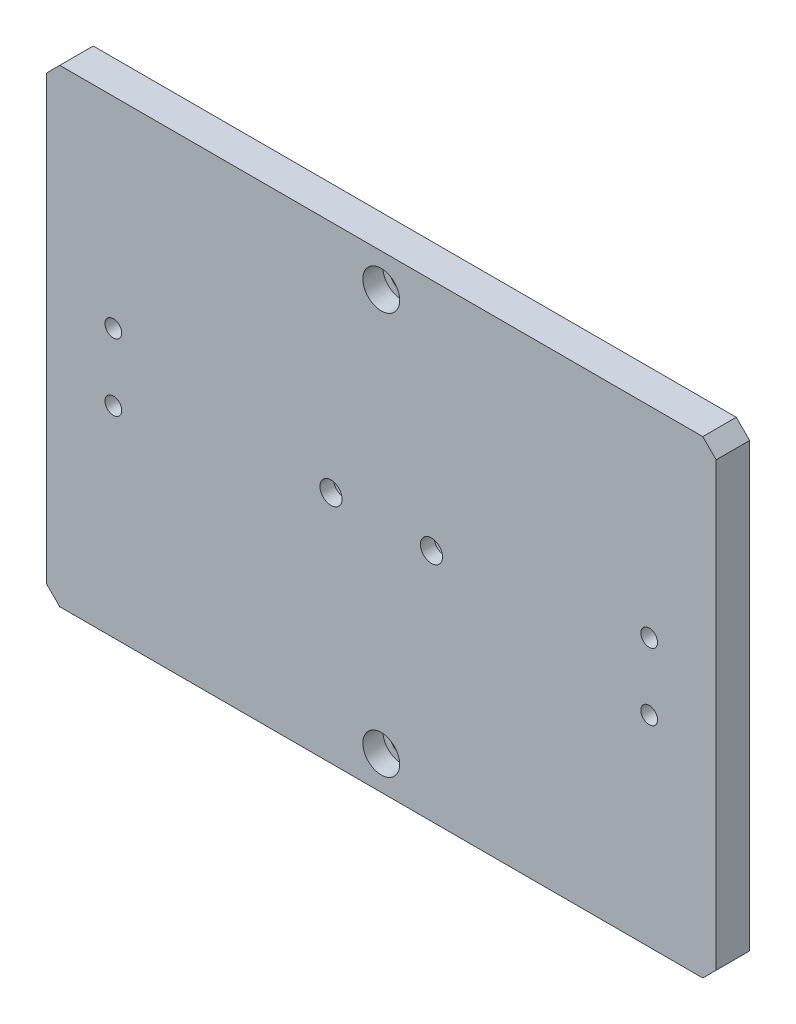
ISO-10303-21;
HEADER;
FILE_DESCRIPTION(('STEP AP214'),'2;1');
FILE_NAME('part.step','',(''),(''),'','','');
FILE_SCHEMA(('AUTOMOTIVE_DESIGN { 1 0 10303 214 1 1 1 1 }'));
ENDSEC;
DATA;
#1=APPLICATION_CONTEXT('core data for automotive mechanical design processes');
#2=APPLICATION_PROTOCOL_DEFINITION('international standard','automotive_design',2000,#1);
#3=PRODUCT_CONTEXT('',#1,'mechanical');
#4=PRODUCT('Part','Part','',(#3));
#5=PRODUCT_RELATED_PRODUCT_CATEGORY('part','',(#4));
#6=PRODUCT_DEFINITION_FORMATION('','',#4);
#7=PRODUCT_DEFINITION_CONTEXT('part definition',#1,'design');
#8=PRODUCT_DEFINITION('design','',#6,#7);
#9=PRODUCT_DEFINITION_SHAPE('','',#8);
#10=(LENGTH_UNIT() NAMED_UNIT(*) SI_UNIT(.MILLI.,.METRE.));
#11=(NAMED_UNIT(*) PLANE_ANGLE_UNIT() SI_UNIT($,.RADIAN.));
#12=(NAMED_UNIT(*) SI_UNIT($,.STERADIAN.) SOLID_ANGLE_UNIT());
#13=UNCERTAINTY_MEASURE_WITH_UNIT(LENGTH_MEASURE(1.E-05),#10,'distance_accuracy_value','');
#14=(GEOMETRIC_REPRESENTATION_CONTEXT(3) GLOBAL_UNCERTAINTY_ASSIGNED_CONTEXT((#13)) GLOBAL_UNIT_ASSIGNED_CONTEXT((#10,
#11,#12)) REPRESENTATION_CONTEXT('',''));
#15=CARTESIAN_POINT('',(0.,0.,0.));
#16=DIRECTION('',(0.,0.,1.));
#17=DIRECTION('',(1.,0.,0.));
#18=AXIS2_PLACEMENT_3D('',#15,#16,#17);
#19=CARTESIAN_POINT('',(0.,0.,10.));
#20=DIRECTION('',(1.,0.,0.));
#21=DIRECTION('',(0.,0.,-1.));
#22=AXIS2_PLACEMENT_3D('',#19,#20,#21);
#23=PLANE('',#22);
#24=DIRECTION('',(0.,-1.,0.));
#25=VECTOR('',#24,1.);
#26=CARTESIAN_POINT('',(0.,0.,10.));
#27=LINE('',#26,#25);
#28=CARTESIAN_POINT('',(0.,136.,10.));
#29=VERTEX_POINT('',#28);
#30=CARTESIAN_POINT('',(0.,4.00000000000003,10.));
#31=VERTEX_POINT('',#30);
#32=EDGE_CURVE('E129',#29,#31,#27,.T.);
#33=ORIENTED_EDGE('',*,*,#32,.F.);
#34=DIRECTION('',(0.,0.,-1.));
#35=VECTOR('',#34,1.);
#36=CARTESIAN_POINT('',(0.,136.,10.));
#37=LINE('',#36,#35);
#38=CARTESIAN_POINT('',(0.,136.,0.));
#39=VERTEX_POINT('',#38);
#40=EDGE_CURVE('E155',#29,#39,#37,.T.);
#41=ORIENTED_EDGE('',*,*,#40,.T.);
#42=DIRECTION('',(0.,-1.,0.));
#43=VECTOR('',#42,1.);
#44=CARTESIAN_POINT('',(0.,0.,0.));
#45=LINE('',#44,#43);
#46=CARTESIAN_POINT('',(0.,4.00000000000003,0.));
#47=VERTEX_POINT('',#46);
#48=EDGE_CURVE('E230',#39,#47,#45,.T.);
#49=ORIENTED_EDGE('',*,*,#48,.T.);
#50=DIRECTION('',(0.,0.,1.));
#51=VECTOR('',#50,1.);
#52=CARTESIAN_POINT('',(0.,4.00000000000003,10.));
#53=LINE('',#52,#51);
#54=EDGE_CURVE('E153',#47,#31,#53,.T.);
#55=ORIENTED_EDGE('',*,*,#54,.T.);
#56=EDGE_LOOP('',(#33,#41,#49,#55));
#57=FACE_BOUND('',#56,.T.);
#58=ADVANCED_FACE('F35',(#57),#23,.F.);
#59=CARTESIAN_POINT('',(0.,0.,10.));
#60=DIRECTION('',(0.,1.,0.));
#61=DIRECTION('',(0.,0.,1.));
#62=AXIS2_PLACEMENT_3D('',#59,#60,#61);
#63=PLANE('',#62);
#64=DIRECTION('',(1.,0.,0.));
#65=VECTOR('',#64,1.);
#66=CARTESIAN_POINT('',(0.,0.,10.));
#67=LINE('',#66,#65);
#68=CARTESIAN_POINT('',(4.,0.,10.));
#69=VERTEX_POINT('',#68);
#70=CARTESIAN_POINT('',(196.,0.,10.));
#71=VERTEX_POINT('',#70);
#72=EDGE_CURVE('E132',#69,#71,#67,.T.);
#73=ORIENTED_EDGE('',*,*,#72,.F.);
#74=DIRECTION('',(0.,0.,-1.));
#75=VECTOR('',#74,1.);
#76=CARTESIAN_POINT('',(4.,0.,10.));
#77=LINE('',#76,#75);
#78=CARTESIAN_POINT('',(4.00000000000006,0.,0.));
#79=VERTEX_POINT('',#78);
#80=EDGE_CURVE('E11',#69,#79,#77,.T.);
#81=ORIENTED_EDGE('',*,*,#80,.T.);
#82=DIRECTION('',(1.,0.,0.));
#83=VECTOR('',#82,1.);
#84=CARTESIAN_POINT('',(0.,0.,0.));
#85=LINE('',#84,#83);
#86=CARTESIAN_POINT('',(196.,0.,0.));
#87=VERTEX_POINT('',#86);
#88=EDGE_CURVE('E134',#79,#87,#85,.T.);
#89=ORIENTED_EDGE('',*,*,#88,.T.);
#90=DIRECTION('',(0.,0.,1.));
#91=VECTOR('',#90,1.);
#92=CARTESIAN_POINT('',(196.,0.,10.));
#93=LINE('',#92,#91);
#94=EDGE_CURVE('E44',#87,#71,#93,.T.);
#95=ORIENTED_EDGE('',*,*,#94,.T.);
#96=EDGE_LOOP('',(#73,#81,#89,#95));
#97=FACE_BOUND('',#96,.T.);
#98=ADVANCED_FACE('F239',(#97),#63,.F.);
#99=CARTESIAN_POINT('',(200.,0.,10.));
#100=DIRECTION('',(-1.,0.,0.));
#101=DIRECTION('',(0.,0.,1.));
#102=AXIS2_PLACEMENT_3D('',#99,#100,#101);
#103=PLANE('',#102);
#104=DIRECTION('',(0.,1.,0.));
#105=VECTOR('',#104,1.);
#106=CARTESIAN_POINT('',(200.,0.,0.));
#107=LINE('',#106,#105);
#108=CARTESIAN_POINT('',(200.,4.00000000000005,0.));
#109=VERTEX_POINT('',#108);
#110=CARTESIAN_POINT('',(200.,136.,0.));
#111=VERTEX_POINT('',#110);
#112=EDGE_CURVE('E130',#109,#111,#107,.T.);
#113=ORIENTED_EDGE('',*,*,#112,.T.);
#114=DIRECTION('',(0.,0.,1.));
#115=VECTOR('',#114,1.);
#116=CARTESIAN_POINT('',(200.,136.,10.));
#117=LINE('',#116,#115);
#118=CARTESIAN_POINT('',(200.,136.,10.));
#119=VERTEX_POINT('',#118);
#120=EDGE_CURVE('E108',#111,#119,#117,.T.);
#121=ORIENTED_EDGE('',*,*,#120,.T.);
#122=DIRECTION('',(0.,1.,0.));
#123=VECTOR('',#122,1.);
#124=CARTESIAN_POINT('',(200.,0.,10.));
#125=LINE('',#124,#123);
#126=CARTESIAN_POINT('',(200.,4.,10.));
#127=VERTEX_POINT('',#126);
#128=EDGE_CURVE('E233',#127,#119,#125,.T.);
#129=ORIENTED_EDGE('',*,*,#128,.F.);
#130=DIRECTION('',(0.,0.,-1.));
#131=VECTOR('',#130,1.);
#132=CARTESIAN_POINT('',(200.,4.,10.));
#133=LINE('',#132,#131);
#134=EDGE_CURVE('E113',#127,#109,#133,.T.);
#135=ORIENTED_EDGE('',*,*,#134,.T.);
#136=EDGE_LOOP('',(#113,#121,#129,#135));
#137=FACE_BOUND('',#136,.T.);
#138=ADVANCED_FACE('F247',(#137),#103,.F.);
#139=CARTESIAN_POINT('',(0.,140.,10.));
#140=DIRECTION('',(0.,-1.,0.));
#141=DIRECTION('',(0.,0.,-1.));
#142=AXIS2_PLACEMENT_3D('',#139,#140,#141);
#143=PLANE('',#142);
#144=DIRECTION('',(-1.,0.,0.));
#145=VECTOR('',#144,1.);
#146=CARTESIAN_POINT('',(0.,140.,10.));
#147=LINE('',#146,#145);
#148=CARTESIAN_POINT('',(196.,140.,10.));
#149=VERTEX_POINT('',#148);
#150=CARTESIAN_POINT('',(4.00000000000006,140.,10.));
#151=VERTEX_POINT('',#150);
#152=EDGE_CURVE('E123',#149,#151,#147,.T.);
#153=ORIENTED_EDGE('',*,*,#152,.F.);
#154=DIRECTION('',(0.,0.,-1.));
#155=VECTOR('',#154,1.);
#156=CARTESIAN_POINT('',(196.,140.,10.));
#157=LINE('',#156,#155);
#158=CARTESIAN_POINT('',(196.,140.,0.));
#159=VERTEX_POINT('',#158);
#160=EDGE_CURVE('E107',#149,#159,#157,.T.);
#161=ORIENTED_EDGE('',*,*,#160,.T.);
#162=DIRECTION('',(-1.,0.,0.));
#163=VECTOR('',#162,1.);
#164=CARTESIAN_POINT('',(0.,140.,0.));
#165=LINE('',#164,#163);
#166=CARTESIAN_POINT('',(4.00000000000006,140.,0.));
#167=VERTEX_POINT('',#166);
#168=EDGE_CURVE('E120',#159,#167,#165,.T.);
#169=ORIENTED_EDGE('',*,*,#168,.T.);
#170=DIRECTION('',(0.,0.,1.));
#171=VECTOR('',#170,1.);
#172=CARTESIAN_POINT('',(4.00000000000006,140.,10.));
#173=LINE('',#172,#171);
#174=EDGE_CURVE('E125',#167,#151,#173,.T.);
#175=ORIENTED_EDGE('',*,*,#174,.T.);
#176=EDGE_LOOP('',(#153,#161,#169,#175));
#177=FACE_BOUND('',#176,.T.);
#178=ADVANCED_FACE('F119',(#177),#143,.F.);
#179=CARTESIAN_POINT('',(0.,140.,10.));
#180=DIRECTION('',(0.,0.,-1.));
#181=DIRECTION('',(-1.,0.,0.));
#182=AXIS2_PLACEMENT_3D('',#179,#180,#181);
#183=PLANE('',#182);
#184=CARTESIAN_POINT('',(20.,60.,10.));
#185=DIRECTION('',(0.,0.,1.));
#186=DIRECTION('',(1.,0.,0.));
#187=AXIS2_PLACEMENT_3D('',#184,#185,#186);
#188=CIRCLE('',#187,2.49999999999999);
#189=CARTESIAN_POINT('',(22.5,60.,10.));
#190=VERTEX_POINT('',#189);
#191=EDGE_CURVE('E172',#190,#190,#188,.T.);
#192=ORIENTED_EDGE('',*,*,#191,.F.);
#193=EDGE_LOOP('',(#192));
#194=FACE_BOUND('',#193,.T.);
#195=CARTESIAN_POINT('',(180.,60.,10.));
#196=DIRECTION('',(0.,0.,1.));
#197=DIRECTION('',(1.,0.,0.));
#198=AXIS2_PLACEMENT_3D('',#195,#196,#197);
#199=CIRCLE('',#198,2.5);
#200=CARTESIAN_POINT('',(182.5,60.,10.));
#201=VERTEX_POINT('',#200);
#202=EDGE_CURVE('E161',#201,#201,#199,.T.);
#203=ORIENTED_EDGE('',*,*,#202,.F.);
#204=EDGE_LOOP('',(#203));
#205=FACE_BOUND('',#204,.T.);
#206=CARTESIAN_POINT('',(20.,80.,10.));
#207=DIRECTION('',(0.,0.,1.));
#208=DIRECTION('',(1.,0.,0.));
#209=AXIS2_PLACEMENT_3D('',#206,#207,#208);
#210=CIRCLE('',#209,2.49999999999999);
#211=CARTESIAN_POINT('',(22.5,80.,10.));
#212=VERTEX_POINT('',#211);
#213=EDGE_CURVE('E160',#212,#212,#210,.T.);
#214=ORIENTED_EDGE('',*,*,#213,.F.);
#215=EDGE_LOOP('',(#214));
#216=FACE_BOUND('',#215,.T.);
#217=CARTESIAN_POINT('',(180.,80.,10.));
#218=DIRECTION('',(0.,0.,1.));
#219=DIRECTION('',(1.,0.,0.));
#220=AXIS2_PLACEMENT_3D('',#217,#218,#219);
#221=CIRCLE('',#220,2.5);
#222=CARTESIAN_POINT('',(182.5,80.,10.));
#223=VERTEX_POINT('',#222);
#224=EDGE_CURVE('E177',#223,#223,#221,.T.);
#225=ORIENTED_EDGE('',*,*,#224,.F.);
#226=EDGE_LOOP('',(#225));
#227=FACE_BOUND('',#226,.T.);
#228=CARTESIAN_POINT('',(100.,130.,10.));
#229=DIRECTION('',(0.,0.,1.));
#230=DIRECTION('',(1.,0.,0.));
#231=AXIS2_PLACEMENT_3D('',#228,#229,#230);
#232=CIRCLE('',#231,5.50000000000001);
#233=CARTESIAN_POINT('',(105.5,130.,10.));
#234=VERTEX_POINT('',#233);
#235=EDGE_CURVE('E183',#234,#234,#232,.T.);
#236=ORIENTED_EDGE('',*,*,#235,.F.);
#237=EDGE_LOOP('',(#236));
#238=FACE_BOUND('',#237,.T.);
#239=CARTESIAN_POINT('',(100.,10.,10.));
#240=DIRECTION('',(0.,0.,1.));
#241=DIRECTION('',(1.,0.,0.));
#242=AXIS2_PLACEMENT_3D('',#239,#240,#241);
#243=CIRCLE('',#242,5.50000000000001);
#244=CARTESIAN_POINT('',(105.5,10.,10.));
#245=VERTEX_POINT('',#244);
#246=EDGE_CURVE('E195',#245,#245,#243,.T.);
#247=ORIENTED_EDGE('',*,*,#246,.F.);
#248=EDGE_LOOP('',(#247));
#249=FACE_BOUND('',#248,.T.);
#250=CARTESIAN_POINT('',(115.,70.,10.));
#251=DIRECTION('',(0.,0.,-1.));
#252=DIRECTION('',(-1.,0.,0.));
#253=AXIS2_PLACEMENT_3D('',#250,#251,#252);
#254=CIRCLE('',#253,3.3);
#255=CARTESIAN_POINT('',(111.7,70.,10.));
#256=VERTEX_POINT('',#255);
#257=EDGE_CURVE('E216',#256,#256,#254,.T.);
#258=ORIENTED_EDGE('',*,*,#257,.T.);
#259=EDGE_LOOP('',(#258));
#260=FACE_BOUND('',#259,.T.);
#261=CARTESIAN_POINT('',(85.,70.,10.));
#262=DIRECTION('',(0.,0.,-1.));
#263=DIRECTION('',(-1.,0.,0.));
#264=AXIS2_PLACEMENT_3D('',#261,#262,#263);
#265=CIRCLE('',#264,3.3);
#266=CARTESIAN_POINT('',(81.7,70.,10.));
#267=VERTEX_POINT('',#266);
#268=EDGE_CURVE('E228',#267,#267,#265,.T.);
#269=ORIENTED_EDGE('',*,*,#268,.T.);
#270=EDGE_LOOP('',(#269));
#271=FACE_BOUND('',#270,.T.);
#272=ORIENTED_EDGE('',*,*,#128,.T.);
#273=DIRECTION('',(0.707106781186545,-0.70710678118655,0.));
#274=VECTOR('',#273,1.);
#275=CARTESIAN_POINT('',(196.,140.,10.));
#276=LINE('',#275,#274);
#277=EDGE_CURVE('E151',#119,#149,#276,.F.);
#278=ORIENTED_EDGE('',*,*,#277,.T.);
#279=ORIENTED_EDGE('',*,*,#152,.T.);
#280=DIRECTION('',(0.70710678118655,0.707106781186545,0.));
#281=VECTOR('',#280,1.);
#282=CARTESIAN_POINT('',(0.,136.,10.));
#283=LINE('',#282,#281);
#284=EDGE_CURVE('E149',#151,#29,#283,.F.);
#285=ORIENTED_EDGE('',*,*,#284,.T.);
#286=ORIENTED_EDGE('',*,*,#32,.T.);
#287=DIRECTION('',(-0.707106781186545,0.70710678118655,0.));
#288=VECTOR('',#287,1.);
#289=CARTESIAN_POINT('',(4.,0.,10.));
#290=LINE('',#289,#288);
#291=EDGE_CURVE('E58',#31,#69,#290,.F.);
#292=ORIENTED_EDGE('',*,*,#291,.T.);
#293=ORIENTED_EDGE('',*,*,#72,.T.);
#294=DIRECTION('',(-0.70710678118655,-0.707106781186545,0.));
#295=VECTOR('',#294,1.);
#296=CARTESIAN_POINT('',(200.,4.,10.));
#297=LINE('',#296,#295);
#298=EDGE_CURVE('E146',#71,#127,#297,.F.);
#299=ORIENTED_EDGE('',*,*,#298,.T.);
#300=EDGE_LOOP('',(#272,#278,#279,#285,#286,#292,#293,#299));
#301=FACE_BOUND('',#300,.T.);
#302=ADVANCED_FACE('F245',(#194,#205,#216,#227,#238,#249,#260,#271,#301),#183,.F.);
#303=CARTESIAN_POINT('',(0.,140.,0.));
#304=DIRECTION('',(0.,0.,-1.));
#305=DIRECTION('',(-1.,0.,0.));
#306=AXIS2_PLACEMENT_3D('',#303,#304,#305);
#307=PLANE('',#306);
#308=CARTESIAN_POINT('',(20.,60.,0.));
#309=DIRECTION('',(0.,0.,-1.));
#310=DIRECTION('',(-1.,0.,0.));
#311=AXIS2_PLACEMENT_3D('',#308,#309,#310);
#312=CIRCLE('',#311,2.49999999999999);
#313=CARTESIAN_POINT('',(17.5,60.,0.));
#314=VERTEX_POINT('',#313);
#315=EDGE_CURVE('E39',#314,#314,#312,.T.);
#316=ORIENTED_EDGE('',*,*,#315,.F.);
#317=EDGE_LOOP('',(#316));
#318=FACE_BOUND('',#317,.T.);
#319=CARTESIAN_POINT('',(180.,60.,0.));
#320=DIRECTION('',(0.,0.,-1.));
#321=DIRECTION('',(-1.,0.,0.));
#322=AXIS2_PLACEMENT_3D('',#319,#320,#321);
#323=CIRCLE('',#322,2.5);
#324=CARTESIAN_POINT('',(177.5,60.,0.));
#325=VERTEX_POINT('',#324);
#326=EDGE_CURVE('E158',#325,#325,#323,.T.);
#327=ORIENTED_EDGE('',*,*,#326,.F.);
#328=EDGE_LOOP('',(#327));
#329=FACE_BOUND('',#328,.T.);
#330=CARTESIAN_POINT('',(20.,80.,0.));
#331=DIRECTION('',(0.,0.,-1.));
#332=DIRECTION('',(-1.,0.,0.));
#333=AXIS2_PLACEMENT_3D('',#330,#331,#332);
#334=CIRCLE('',#333,2.49999999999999);
#335=CARTESIAN_POINT('',(17.5,80.,0.));
#336=VERTEX_POINT('',#335);
#337=EDGE_CURVE('E165',#336,#336,#334,.T.);
#338=ORIENTED_EDGE('',*,*,#337,.F.);
#339=EDGE_LOOP('',(#338));
#340=FACE_BOUND('',#339,.T.);
#341=CARTESIAN_POINT('',(180.,80.,0.));
#342=DIRECTION('',(0.,0.,-1.));
#343=DIRECTION('',(-1.,0.,0.));
#344=AXIS2_PLACEMENT_3D('',#341,#342,#343);
#345=CIRCLE('',#344,2.49999999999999);
#346=CARTESIAN_POINT('',(177.5,80.,0.));
#347=VERTEX_POINT('',#346);
#348=EDGE_CURVE('E180',#347,#347,#345,.T.);
#349=ORIENTED_EDGE('',*,*,#348,.F.);
#350=EDGE_LOOP('',(#349));
#351=FACE_BOUND('',#350,.T.);
#352=CARTESIAN_POINT('',(100.,130.,0.));
#353=DIRECTION('',(0.,0.,1.));
#354=DIRECTION('',(1.,0.,0.));
#355=AXIS2_PLACEMENT_3D('',#352,#353,#354);
#356=CIRCLE('',#355,3.3);
#357=CARTESIAN_POINT('',(103.3,130.,0.));
#358=VERTEX_POINT('',#357);
#359=EDGE_CURVE('E192',#358,#358,#356,.T.);
#360=ORIENTED_EDGE('',*,*,#359,.T.);
#361=EDGE_LOOP('',(#360));
#362=FACE_BOUND('',#361,.T.);
#363=CARTESIAN_POINT('',(100.,10.,0.));
#364=DIRECTION('',(0.,0.,1.));
#365=DIRECTION('',(1.,0.,0.));
#366=AXIS2_PLACEMENT_3D('',#363,#364,#365);
#367=CIRCLE('',#366,3.3);
#368=CARTESIAN_POINT('',(103.3,10.,0.));
#369=VERTEX_POINT('',#368);
#370=EDGE_CURVE('E204',#369,#369,#367,.T.);
#371=ORIENTED_EDGE('',*,*,#370,.T.);
#372=EDGE_LOOP('',(#371));
#373=FACE_BOUND('',#372,.T.);
#374=CARTESIAN_POINT('',(115.,70.,0.));
#375=DIRECTION('',(0.,0.,-1.));
#376=DIRECTION('',(-1.,0.,0.));
#377=AXIS2_PLACEMENT_3D('',#374,#375,#376);
#378=CIRCLE('',#377,5.49999999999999);
#379=CARTESIAN_POINT('',(109.5,70.,0.));
#380=VERTEX_POINT('',#379);
#381=EDGE_CURVE('E207',#380,#380,#378,.T.);
#382=ORIENTED_EDGE('',*,*,#381,.F.);
#383=EDGE_LOOP('',(#382));
#384=FACE_BOUND('',#383,.T.);
#385=CARTESIAN_POINT('',(85.,70.,0.));
#386=DIRECTION('',(0.,0.,-1.));
#387=DIRECTION('',(-1.,0.,0.));
#388=AXIS2_PLACEMENT_3D('',#385,#386,#387);
#389=CIRCLE('',#388,5.49999999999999);
#390=CARTESIAN_POINT('',(79.5,70.,0.));
#391=VERTEX_POINT('',#390);
#392=EDGE_CURVE('E219',#391,#391,#389,.T.);
#393=ORIENTED_EDGE('',*,*,#392,.F.);
#394=EDGE_LOOP('',(#393));
#395=FACE_BOUND('',#394,.T.);
#396=ORIENTED_EDGE('',*,*,#168,.F.);
#397=DIRECTION('',(-0.707106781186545,0.70710678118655,0.));
#398=VECTOR('',#397,1.);
#399=CARTESIAN_POINT('',(98.0000000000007,238.,0.));
#400=LINE('',#399,#398);
#401=EDGE_CURVE('E103',#159,#111,#400,.F.);
#402=ORIENTED_EDGE('',*,*,#401,.T.);
#403=ORIENTED_EDGE('',*,*,#112,.F.);
#404=DIRECTION('',(0.70710678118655,0.707106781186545,0.));
#405=VECTOR('',#404,1.);
#406=CARTESIAN_POINT('',(167.999999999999,-28.0000000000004,0.));
#407=LINE('',#406,#405);
#408=EDGE_CURVE('E124',#109,#87,#407,.F.);
#409=ORIENTED_EDGE('',*,*,#408,.T.);
#410=ORIENTED_EDGE('',*,*,#88,.F.);
#411=DIRECTION('',(0.707106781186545,-0.70710678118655,0.));
#412=VECTOR('',#411,1.);
#413=CARTESIAN_POINT('',(-68.,72.0000000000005,0.));
#414=LINE('',#413,#412);
#415=EDGE_CURVE('E140',#79,#47,#414,.F.);
#416=ORIENTED_EDGE('',*,*,#415,.T.);
#417=ORIENTED_EDGE('',*,*,#48,.F.);
#418=DIRECTION('',(-0.70710678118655,-0.707106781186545,0.));
#419=VECTOR('',#418,1.);
#420=CARTESIAN_POINT('',(2.00000000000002,138.,0.));
#421=LINE('',#420,#419);
#422=EDGE_CURVE('E114',#39,#167,#421,.F.);
#423=ORIENTED_EDGE('',*,*,#422,.T.);
#424=EDGE_LOOP('',(#396,#402,#403,#409,#410,#416,#417,#423));
#425=FACE_BOUND('',#424,.T.);
#426=ADVANCED_FACE('F127',(#318,#329,#340,#351,#362,#373,#384,#395,#425),#307,.T.);
#427=CARTESIAN_POINT('',(196.,140.,10.));
#428=DIRECTION('',(-0.70710678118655,-0.707106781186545,0.));
#429=DIRECTION('',(0.707106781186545,-0.70710678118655,0.));
#430=AXIS2_PLACEMENT_3D('',#427,#428,#429);
#431=PLANE('',#430);
#432=ORIENTED_EDGE('',*,*,#277,.F.);
#433=ORIENTED_EDGE('',*,*,#120,.F.);
#434=ORIENTED_EDGE('',*,*,#401,.F.);
#435=ORIENTED_EDGE('',*,*,#160,.F.);
#436=EDGE_LOOP('',(#432,#433,#434,#435));
#437=FACE_BOUND('',#436,.T.);
#438=ADVANCED_FACE('F106',(#437),#431,.F.);
#439=CARTESIAN_POINT('',(0.,136.,10.));
#440=DIRECTION('',(0.707106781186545,-0.70710678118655,0.));
#441=DIRECTION('',(0.70710678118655,0.707106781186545,0.));
#442=AXIS2_PLACEMENT_3D('',#439,#440,#441);
#443=PLANE('',#442);
#444=ORIENTED_EDGE('',*,*,#284,.F.);
#445=ORIENTED_EDGE('',*,*,#174,.F.);
#446=ORIENTED_EDGE('',*,*,#422,.F.);
#447=ORIENTED_EDGE('',*,*,#40,.F.);
#448=EDGE_LOOP('',(#444,#445,#446,#447));
#449=FACE_BOUND('',#448,.T.);
#450=ADVANCED_FACE('F265',(#449),#443,.F.);
#451=CARTESIAN_POINT('',(4.,0.,10.));
#452=DIRECTION('',(0.70710678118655,0.707106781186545,0.));
#453=DIRECTION('',(-0.707106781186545,0.70710678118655,0.));
#454=AXIS2_PLACEMENT_3D('',#451,#452,#453);
#455=PLANE('',#454);
#456=ORIENTED_EDGE('',*,*,#291,.F.);
#457=ORIENTED_EDGE('',*,*,#54,.F.);
#458=ORIENTED_EDGE('',*,*,#415,.F.);
#459=ORIENTED_EDGE('',*,*,#80,.F.);
#460=EDGE_LOOP('',(#456,#457,#458,#459));
#461=FACE_BOUND('',#460,.T.);
#462=ADVANCED_FACE('F267',(#461),#455,.F.);
#463=CARTESIAN_POINT('',(200.,4.,10.));
#464=DIRECTION('',(-0.707106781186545,0.70710678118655,0.));
#465=DIRECTION('',(-0.70710678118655,-0.707106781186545,0.));
#466=AXIS2_PLACEMENT_3D('',#463,#464,#465);
#467=PLANE('',#466);
#468=ORIENTED_EDGE('',*,*,#298,.F.);
#469=ORIENTED_EDGE('',*,*,#94,.F.);
#470=ORIENTED_EDGE('',*,*,#408,.F.);
#471=ORIENTED_EDGE('',*,*,#134,.F.);
#472=EDGE_LOOP('',(#468,#469,#470,#471));
#473=FACE_BOUND('',#472,.T.);
#474=ADVANCED_FACE('F37',(#473),#467,.F.);
#475=CARTESIAN_POINT('',(85.,70.,0.));
#476=DIRECTION('',(0.,0.,-1.));
#477=DIRECTION('',(-1.,0.,0.));
#478=AXIS2_PLACEMENT_3D('',#475,#476,#477);
#479=CYLINDRICAL_SURFACE('',#478,3.3);
#480=ORIENTED_EDGE('',*,*,#268,.F.);
#481=EDGE_LOOP('',(#480));
#482=FACE_BOUND('',#481,.T.);
#483=CARTESIAN_POINT('',(85.,70.,6.));
#484=DIRECTION('',(0.,0.,-1.));
#485=DIRECTION('',(-1.,0.,0.));
#486=AXIS2_PLACEMENT_3D('',#483,#484,#485);
#487=CIRCLE('',#486,3.3);
#488=CARTESIAN_POINT('',(81.7,70.,6.));
#489=VERTEX_POINT('',#488);
#490=EDGE_CURVE('E225',#489,#489,#487,.T.);
#491=ORIENTED_EDGE('',*,*,#490,.T.);
#492=EDGE_LOOP('',(#491));
#493=FACE_BOUND('',#492,.T.);
#494=ADVANCED_FACE('F274',(#482,#493),#479,.F.);
#495=CARTESIAN_POINT('',(88.3,70.,6.));
#496=DIRECTION('',(0.,0.,1.));
#497=DIRECTION('',(1.,0.,0.));
#498=AXIS2_PLACEMENT_3D('',#495,#496,#497);
#499=PLANE('',#498);
#500=ORIENTED_EDGE('',*,*,#490,.F.);
#501=EDGE_LOOP('',(#500));
#502=FACE_BOUND('',#501,.T.);
#503=CARTESIAN_POINT('',(85.,70.,6.));
#504=DIRECTION('',(0.,0.,-1.));
#505=DIRECTION('',(-1.,0.,0.));
#506=AXIS2_PLACEMENT_3D('',#503,#504,#505);
#507=CIRCLE('',#506,5.49999999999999);
#508=CARTESIAN_POINT('',(79.5,70.,6.));
#509=VERTEX_POINT('',#508);
#510=EDGE_CURVE('E222',#509,#509,#507,.T.);
#511=ORIENTED_EDGE('',*,*,#510,.T.);
#512=EDGE_LOOP('',(#511));
#513=FACE_BOUND('',#512,.T.);
#514=ADVANCED_FACE('F281',(#502,#513),#499,.F.);
#515=CARTESIAN_POINT('',(85.,70.,0.));
#516=DIRECTION('',(0.,0.,-1.));
#517=DIRECTION('',(-1.,0.,0.));
#518=AXIS2_PLACEMENT_3D('',#515,#516,#517);
#519=CYLINDRICAL_SURFACE('',#518,5.49999999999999);
#520=ORIENTED_EDGE('',*,*,#510,.F.);
#521=EDGE_LOOP('',(#520));
#522=FACE_BOUND('',#521,.T.);
#523=ORIENTED_EDGE('',*,*,#392,.T.);
#524=EDGE_LOOP('',(#523));
#525=FACE_BOUND('',#524,.T.);
#526=ADVANCED_FACE('F287',(#522,#525),#519,.F.);
#527=CARTESIAN_POINT('',(115.,70.,0.));
#528=DIRECTION('',(0.,0.,-1.));
#529=DIRECTION('',(-1.,0.,0.));
#530=AXIS2_PLACEMENT_3D('',#527,#528,#529);
#531=CYLINDRICAL_SURFACE('',#530,3.3);
#532=ORIENTED_EDGE('',*,*,#257,.F.);
#533=EDGE_LOOP('',(#532));
#534=FACE_BOUND('',#533,.T.);
#535=CARTESIAN_POINT('',(115.,70.,6.));
#536=DIRECTION('',(0.,0.,-1.));
#537=DIRECTION('',(-1.,0.,0.));
#538=AXIS2_PLACEMENT_3D('',#535,#536,#537);
#539=CIRCLE('',#538,3.3);
#540=CARTESIAN_POINT('',(111.7,70.,6.));
#541=VERTEX_POINT('',#540);
#542=EDGE_CURVE('E213',#541,#541,#539,.T.);
#543=ORIENTED_EDGE('',*,*,#542,.T.);
#544=EDGE_LOOP('',(#543));
#545=FACE_BOUND('',#544,.T.);
#546=ADVANCED_FACE('F317',(#534,#545),#531,.F.);
#547=CARTESIAN_POINT('',(118.3,70.,6.));
#548=DIRECTION('',(0.,0.,1.));
#549=DIRECTION('',(1.,0.,0.));
#550=AXIS2_PLACEMENT_3D('',#547,#548,#549);
#551=PLANE('',#550);
#552=ORIENTED_EDGE('',*,*,#542,.F.);
#553=EDGE_LOOP('',(#552));
#554=FACE_BOUND('',#553,.T.);
#555=CARTESIAN_POINT('',(115.,70.,6.));
#556=DIRECTION('',(0.,0.,-1.));
#557=DIRECTION('',(-1.,0.,0.));
#558=AXIS2_PLACEMENT_3D('',#555,#556,#557);
#559=CIRCLE('',#558,5.49999999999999);
#560=CARTESIAN_POINT('',(109.5,70.,6.));
#561=VERTEX_POINT('',#560);
#562=EDGE_CURVE('E210',#561,#561,#559,.T.);
#563=ORIENTED_EDGE('',*,*,#562,.T.);
#564=EDGE_LOOP('',(#563));
#565=FACE_BOUND('',#564,.T.);
#566=ADVANCED_FACE('F322',(#554,#565),#551,.F.);
#567=CARTESIAN_POINT('',(115.,70.,0.));
#568=DIRECTION('',(0.,0.,-1.));
#569=DIRECTION('',(-1.,0.,0.));
#570=AXIS2_PLACEMENT_3D('',#567,#568,#569);
#571=CYLINDRICAL_SURFACE('',#570,5.49999999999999);
#572=ORIENTED_EDGE('',*,*,#562,.F.);
#573=EDGE_LOOP('',(#572));
#574=FACE_BOUND('',#573,.T.);
#575=ORIENTED_EDGE('',*,*,#381,.T.);
#576=EDGE_LOOP('',(#575));
#577=FACE_BOUND('',#576,.T.);
#578=ADVANCED_FACE('F329',(#574,#577),#571,.F.);
#579=CARTESIAN_POINT('',(100.,10.,10.));
#580=DIRECTION('',(0.,0.,1.));
#581=DIRECTION('',(1.,0.,0.));
#582=AXIS2_PLACEMENT_3D('',#579,#580,#581);
#583=CYLINDRICAL_SURFACE('',#582,3.3);
#584=ORIENTED_EDGE('',*,*,#370,.F.);
#585=EDGE_LOOP('',(#584));
#586=FACE_BOUND('',#585,.T.);
#587=CARTESIAN_POINT('',(100.,10.,4.));
#588=DIRECTION('',(0.,0.,1.));
#589=DIRECTION('',(1.,0.,0.));
#590=AXIS2_PLACEMENT_3D('',#587,#588,#589);
#591=CIRCLE('',#590,3.3);
#592=CARTESIAN_POINT('',(103.3,10.,4.));
#593=VERTEX_POINT('',#592);
#594=EDGE_CURVE('E201',#593,#593,#591,.T.);
#595=ORIENTED_EDGE('',*,*,#594,.T.);
#596=EDGE_LOOP('',(#595));
#597=FACE_BOUND('',#596,.T.);
#598=ADVANCED_FACE('F333',(#586,#597),#583,.F.);
#599=CARTESIAN_POINT('',(103.3,10.,4.));
#600=DIRECTION('',(0.,0.,-1.));
#601=DIRECTION('',(-1.,0.,0.));
#602=AXIS2_PLACEMENT_3D('',#599,#600,#601);
#603=PLANE('',#602);
#604=ORIENTED_EDGE('',*,*,#594,.F.);
#605=EDGE_LOOP('',(#604));
#606=FACE_BOUND('',#605,.T.);
#607=CARTESIAN_POINT('',(100.,10.,4.));
#608=DIRECTION('',(0.,0.,1.));
#609=DIRECTION('',(1.,0.,0.));
#610=AXIS2_PLACEMENT_3D('',#607,#608,#609);
#611=CIRCLE('',#610,5.49999999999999);
#612=CARTESIAN_POINT('',(105.5,10.,4.));
#613=VERTEX_POINT('',#612);
#614=EDGE_CURVE('E198',#613,#613,#611,.T.);
#615=ORIENTED_EDGE('',*,*,#614,.T.);
#616=EDGE_LOOP('',(#615));
#617=FACE_BOUND('',#616,.T.);
#618=ADVANCED_FACE('F337',(#606,#617),#603,.F.);
#619=CARTESIAN_POINT('',(100.,10.,10.));
#620=DIRECTION('',(0.,0.,1.));
#621=DIRECTION('',(1.,0.,0.));
#622=AXIS2_PLACEMENT_3D('',#619,#620,#621);
#623=CYLINDRICAL_SURFACE('',#622,5.5);
#624=ORIENTED_EDGE('',*,*,#614,.F.);
#625=EDGE_LOOP('',(#624));
#626=FACE_BOUND('',#625,.T.);
#627=ORIENTED_EDGE('',*,*,#246,.T.);
#628=EDGE_LOOP('',(#627));
#629=FACE_BOUND('',#628,.T.);
#630=ADVANCED_FACE('F341',(#626,#629),#623,.F.);
#631=CARTESIAN_POINT('',(100.,130.,10.));
#632=DIRECTION('',(0.,0.,1.));
#633=DIRECTION('',(1.,0.,0.));
#634=AXIS2_PLACEMENT_3D('',#631,#632,#633);
#635=CYLINDRICAL_SURFACE('',#634,3.3);
#636=ORIENTED_EDGE('',*,*,#359,.F.);
#637=EDGE_LOOP('',(#636));
#638=FACE_BOUND('',#637,.T.);
#639=CARTESIAN_POINT('',(100.,130.,4.));
#640=DIRECTION('',(0.,0.,1.));
#641=DIRECTION('',(1.,0.,0.));
#642=AXIS2_PLACEMENT_3D('',#639,#640,#641);
#643=CIRCLE('',#642,3.3);
#644=CARTESIAN_POINT('',(103.3,130.,4.));
#645=VERTEX_POINT('',#644);
#646=EDGE_CURVE('E189',#645,#645,#643,.T.);
#647=ORIENTED_EDGE('',*,*,#646,.T.);
#648=EDGE_LOOP('',(#647));
#649=FACE_BOUND('',#648,.T.);
#650=ADVANCED_FACE('F345',(#638,#649),#635,.F.);
#651=CARTESIAN_POINT('',(103.3,130.,4.));
#652=DIRECTION('',(0.,0.,-1.));
#653=DIRECTION('',(-1.,0.,0.));
#654=AXIS2_PLACEMENT_3D('',#651,#652,#653);
#655=PLANE('',#654);
#656=ORIENTED_EDGE('',*,*,#646,.F.);
#657=EDGE_LOOP('',(#656));
#658=FACE_BOUND('',#657,.T.);
#659=CARTESIAN_POINT('',(100.,130.,4.));
#660=DIRECTION('',(0.,0.,1.));
#661=DIRECTION('',(1.,0.,0.));
#662=AXIS2_PLACEMENT_3D('',#659,#660,#661);
#663=CIRCLE('',#662,5.50000000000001);
#664=CARTESIAN_POINT('',(105.5,130.,4.));
#665=VERTEX_POINT('',#664);
#666=EDGE_CURVE('E186',#665,#665,#663,.T.);
#667=ORIENTED_EDGE('',*,*,#666,.T.);
#668=EDGE_LOOP('',(#667));
#669=FACE_BOUND('',#668,.T.);
#670=ADVANCED_FACE('F349',(#658,#669),#655,.F.);
#671=CARTESIAN_POINT('',(100.,130.,10.));
#672=DIRECTION('',(0.,0.,1.));
#673=DIRECTION('',(1.,0.,0.));
#674=AXIS2_PLACEMENT_3D('',#671,#672,#673);
#675=CYLINDRICAL_SURFACE('',#674,5.50000000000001);
#676=ORIENTED_EDGE('',*,*,#666,.F.);
#677=EDGE_LOOP('',(#676));
#678=FACE_BOUND('',#677,.T.);
#679=ORIENTED_EDGE('',*,*,#235,.T.);
#680=EDGE_LOOP('',(#679));
#681=FACE_BOUND('',#680,.T.);
#682=ADVANCED_FACE('F353',(#678,#681),#675,.F.);
#683=CARTESIAN_POINT('',(180.,80.,10.));
#684=DIRECTION('',(0.,0.,1.));
#685=DIRECTION('',(1.,0.,0.));
#686=AXIS2_PLACEMENT_3D('',#683,#684,#685);
#687=CYLINDRICAL_SURFACE('',#686,2.49999999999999);
#688=ORIENTED_EDGE('',*,*,#348,.T.);
#689=EDGE_LOOP('',(#688));
#690=FACE_BOUND('',#689,.T.);
#691=ORIENTED_EDGE('',*,*,#224,.T.);
#692=EDGE_LOOP('',(#691));
#693=FACE_BOUND('',#692,.T.);
#694=ADVANCED_FACE('F357',(#690,#693),#687,.F.);
#695=CARTESIAN_POINT('',(20.,80.,10.));
#696=DIRECTION('',(0.,0.,1.));
#697=DIRECTION('',(1.,0.,0.));
#698=AXIS2_PLACEMENT_3D('',#695,#696,#697);
#699=CYLINDRICAL_SURFACE('',#698,2.49999999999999);
#700=ORIENTED_EDGE('',*,*,#337,.T.);
#701=EDGE_LOOP('',(#700));
#702=FACE_BOUND('',#701,.T.);
#703=ORIENTED_EDGE('',*,*,#213,.T.);
#704=EDGE_LOOP('',(#703));
#705=FACE_BOUND('',#704,.T.);
#706=ADVANCED_FACE('F361',(#702,#705),#699,.F.);
#707=CARTESIAN_POINT('',(180.,60.,10.));
#708=DIRECTION('',(0.,0.,1.));
#709=DIRECTION('',(1.,0.,0.));
#710=AXIS2_PLACEMENT_3D('',#707,#708,#709);
#711=CYLINDRICAL_SURFACE('',#710,2.5);
#712=ORIENTED_EDGE('',*,*,#326,.T.);
#713=EDGE_LOOP('',(#712));
#714=FACE_BOUND('',#713,.T.);
#715=ORIENTED_EDGE('',*,*,#202,.T.);
#716=EDGE_LOOP('',(#715));
#717=FACE_BOUND('',#716,.T.);
#718=ADVANCED_FACE('F365',(#714,#717),#711,.F.);
#719=CARTESIAN_POINT('',(20.,60.,10.));
#720=DIRECTION('',(0.,0.,1.));
#721=DIRECTION('',(1.,0.,0.));
#722=AXIS2_PLACEMENT_3D('',#719,#720,#721);
#723=CYLINDRICAL_SURFACE('',#722,2.49999999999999);
#724=ORIENTED_EDGE('',*,*,#315,.T.);
#725=EDGE_LOOP('',(#724));
#726=FACE_BOUND('',#725,.T.);
#727=ORIENTED_EDGE('',*,*,#191,.T.);
#728=EDGE_LOOP('',(#727));
#729=FACE_BOUND('',#728,.T.);
#730=ADVANCED_FACE('F369',(#726,#729),#723,.F.);
#731=CLOSED_SHELL('',(#58,#98,#138,#178,#302,#426,#438,#450,#462,#474,#494,#514,#526,#546,#566,
#578,#598,#618,#630,#650,#670,#682,#694,#706,#718,#730));
#732=MANIFOLD_SOLID_BREP('B2',#731);
#733=ADVANCED_BREP_SHAPE_REPRESENTATION('',(#18,#732),#14);
#734=SHAPE_DEFINITION_REPRESENTATION(#9,#733);
ENDSEC;
END-ISO-10303-21;
